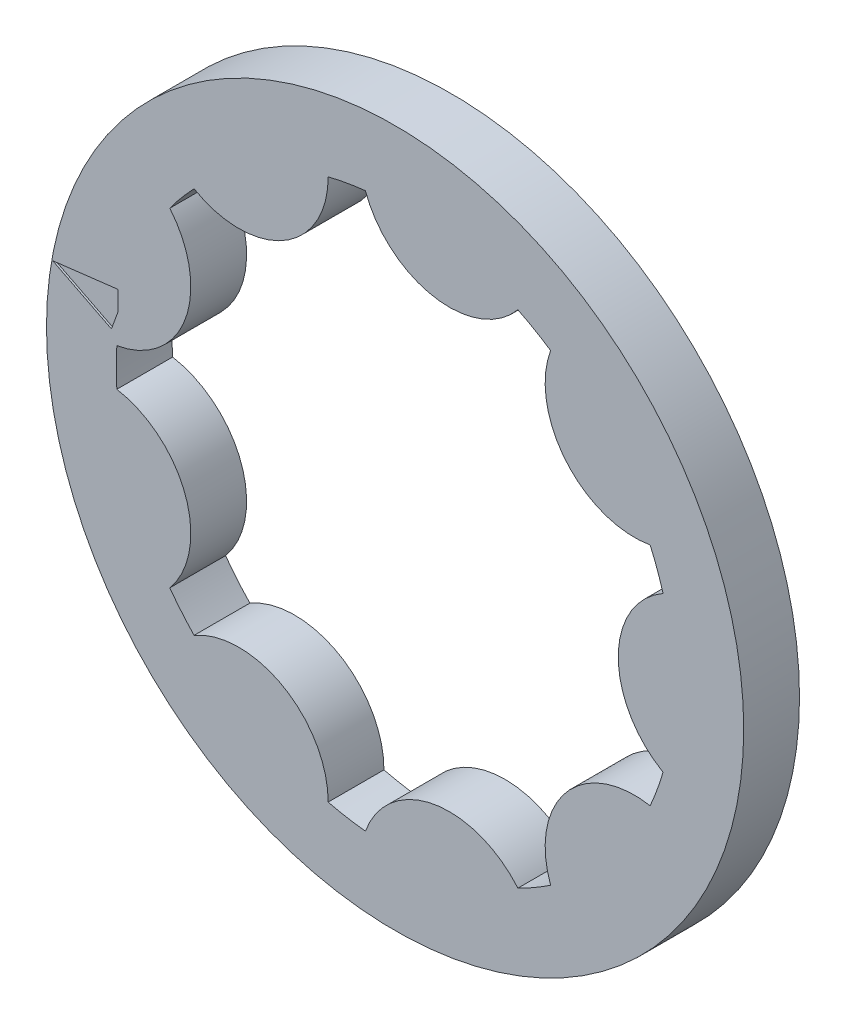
from build123d import *

# Parameters (mm, degrees)
ESQUISSE1_R             = 18.75
BASE_EXTRUSION_DEPTH    = 3
ENL_V_MAT_EXTRU_1_DEPTH = 0.1


with BuildPart() as part:
    # Esquisse1 → Base-Extrusion (new body)
    with BuildSketch(Plane.XY):
        Circle(ESQUISSE1_R)
        with BuildLine():
            ThreePointArc((9.192533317, 7.713451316), (11.233659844, 6.286196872), (13.715229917, 6.07391705))
            ThreePointArc((13.715229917, 6.07391705), (14.095389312, 5.13030215), (14.410714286, 4.163089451))
            ThreePointArc((14.410714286, 4.163089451), (12.646172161, 2.405351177), (12, 0))
            ThreePointArc((12, 0), (12.646172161, -2.405351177), (14.410714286, -4.163089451))
            ThreePointArc((14.410714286, -4.163089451), (14.095389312, -5.13030215), (13.715229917, -6.07391705))
            ThreePointArc((13.715229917, -6.07391705), (11.233659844, -6.286196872), (9.192533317, -7.713451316))
            ThreePointArc((9.192533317, -7.713451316), (8.141399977, -9.971408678), (8.363265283, -12.45214013))
            ThreePointArc((8.363265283, -12.45214013), (7.5, -12.990381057), (6.602237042, -13.468870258))
            ThreePointArc((6.602237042, -13.468870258), (4.564793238, -12.036363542), (2.083778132, -11.817693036))
            ThreePointArc((2.083778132, -11.817693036), (-0.172823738, -12.871733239), (-1.597448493, -14.914696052))
            ThreePointArc((-1.597448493, -14.914696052), (-2.604722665, -14.772116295), (-3.60001592, -14.561589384))
            ThreePointArc((-3.60001592, -14.561589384), (-4.239990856, -12.154581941), (-6, -10.392304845))
            ThreePointArc((-6, -10.392304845), (-8.406181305, -9.749230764), (-10.810698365, -10.398499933))
            ThreePointArc((-10.810698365, -10.398499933), (-11.490666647, -9.641814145), (-12.117781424, -8.840779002))
            ThreePointArc((-12.117781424, -8.840779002), (-11.060836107, -6.585536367), (-11.276311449, -4.10424172))
            ThreePointArc((-11.276311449, -4.10424172), (-12.706193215, -2.064954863), (-14.965502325, -1.016730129))
            ThreePointArc((-14.965502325, -1.016730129), (-15, 0), (-14.965502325, 1.016730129))
            ThreePointArc((-14.965502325, 1.016730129), (-12.706193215, 2.064954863), (-11.276311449, 4.10424172))
            ThreePointArc((-11.276311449, 4.10424172), (-11.060836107, 6.585536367), (-12.117781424, 8.840779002))
            ThreePointArc((-12.117781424, 8.840779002), (-11.490666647, 9.641814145), (-10.810698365, 10.398499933))
            ThreePointArc((-10.810698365, 10.398499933), (-8.406181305, 9.749230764), (-6, 10.392304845))
            ThreePointArc((-6, 10.392304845), (-4.239990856, 12.154581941), (-3.60001592, 14.561589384))
            ThreePointArc((-3.60001592, 14.561589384), (-2.604722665, 14.772116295), (-1.597448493, 14.914696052))
            ThreePointArc((-1.597448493, 14.914696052), (-0.172823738, 12.871733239), (2.083778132, 11.817693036))
            ThreePointArc((2.083778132, 11.817693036), (4.564793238, 12.036363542), (6.602237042, 13.468870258))
            ThreePointArc((6.602237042, 13.468870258), (7.5, 12.990381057), (8.363265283, 12.45214013))
            ThreePointArc((8.363265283, 12.45214013), (8.141399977, 9.971408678), (9.192533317, 7.713451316))
        make_face(mode=Mode.SUBTRACT)
    extrude(amount=BASE_EXTRUSION_DEPTH)

    # Esquisse2 → Enl_v. mat.-Extru.1 (cut)
    with BuildSketch(Plane.XY.offset(3)):
        Polygon((-18.412571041, 3.246633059), (-14.900955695, 3.668069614), (-14.900955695, 2.627440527), (-15.256871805, 1.649569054), align=None)
    extrude(amount=-ENL_V_MAT_EXTRU_1_DEPTH, mode=Mode.SUBTRACT)


solid = part.part
